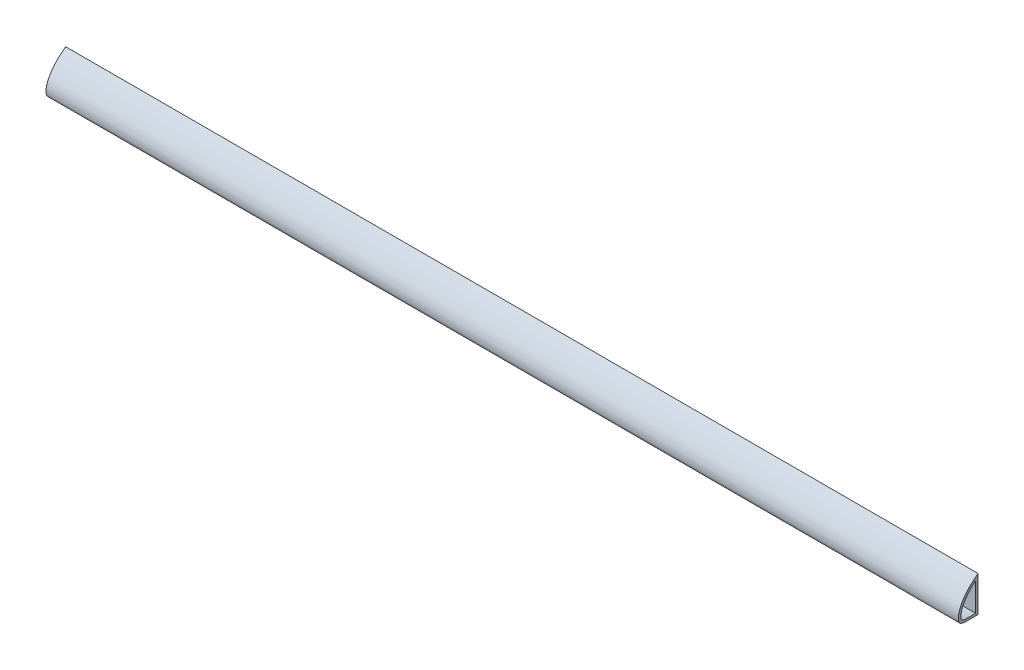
from build123d import *

# Parameters (mm, degrees)
BOSS_EXTRUDE1_DEPTH = 147.6375


with BuildPart() as part:
    # Sketch1 → Boss-Extrude1 (new, symmetric)
    with BuildSketch(Plane(origin=(0, 0, 0), x_dir=(0, 0, -1), z_dir=(1, 0, 0))):
        with BuildLine():
            Line((6.35, 9.311423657), (6.35, -2.210463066))
            add(Edge.make_bspline(
                [(6.35, 9.311423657), (6.109405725, 9.132512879), (5.278301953, 8.496194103), (3.96958394, 7.382899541), (2.577103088, 5.911074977), (1.507380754, 4.433648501), (0.717084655, 2.996223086), (0.21043576, 1.631371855), (-0.0311923, 0.371536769), (0.014997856, -0.69407136), (0.289002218, -1.671485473), (1.308604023, -2.156985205), (2.679673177, -2.22552208), (4.418393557, -2.287274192), (5.697874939, -2.242226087), (6.35, -2.210463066)],
                knots=[0.473049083, 0.473049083, 0.473049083, 0.473049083, 0.475988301, 0.483308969, 0.489874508, 0.49580325, 0.501149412, 0.505903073, 0.510046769, 0.513579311, 0.516446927, 0.519350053, 0.523823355, 0.529973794, 0.536375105, 0.536375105, 0.536375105, 0.536375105], degree=3))
        make_face()
        with BuildLine():
            Line((5.55625, 7.677987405), (5.55625, -1.449572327))
            add(Edge.make_bspline(
                [(5.55625, -1.449572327), (5.211407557, -1.46152507), (4.518043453, -1.477574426), (3.49763559, -1.4602432), (2.414007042, -1.420494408), (1.656306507, -1.368481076), (1.210403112, -1.220906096), (1.047153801, -1.125718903), (0.994978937, -1.077492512), (0.966729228, -1.037710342), (0.893336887, -0.872935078), (0.819829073, -0.50649794), (0.786056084, -0.07402976), (0.808236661, 0.508823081), (0.954864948, 1.280684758), (1.261647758, 2.200871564), (1.80935606, 3.38731761), (2.707426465, 4.803931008), (4.01853736, 6.322270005), (5.034361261, 7.242565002), (5.55625, 7.677987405)],
                knots=[0.478462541, 0.478462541, 0.478462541, 0.478462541, 0.481925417, 0.485388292, 0.488851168, 0.492314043, 0.494045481, 0.4949112, 0.495776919, 0.496642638, 0.497508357, 0.499239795, 0.500971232, 0.50270267, 0.506165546, 0.509628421, 0.513091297, 0.520017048, 0.526942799, 0.533868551, 0.533868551, 0.533868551, 0.533868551], degree=3))
        make_face(mode=Mode.SUBTRACT)
    extrude(amount=BOSS_EXTRUDE1_DEPTH, both=True)


solid = part.part
